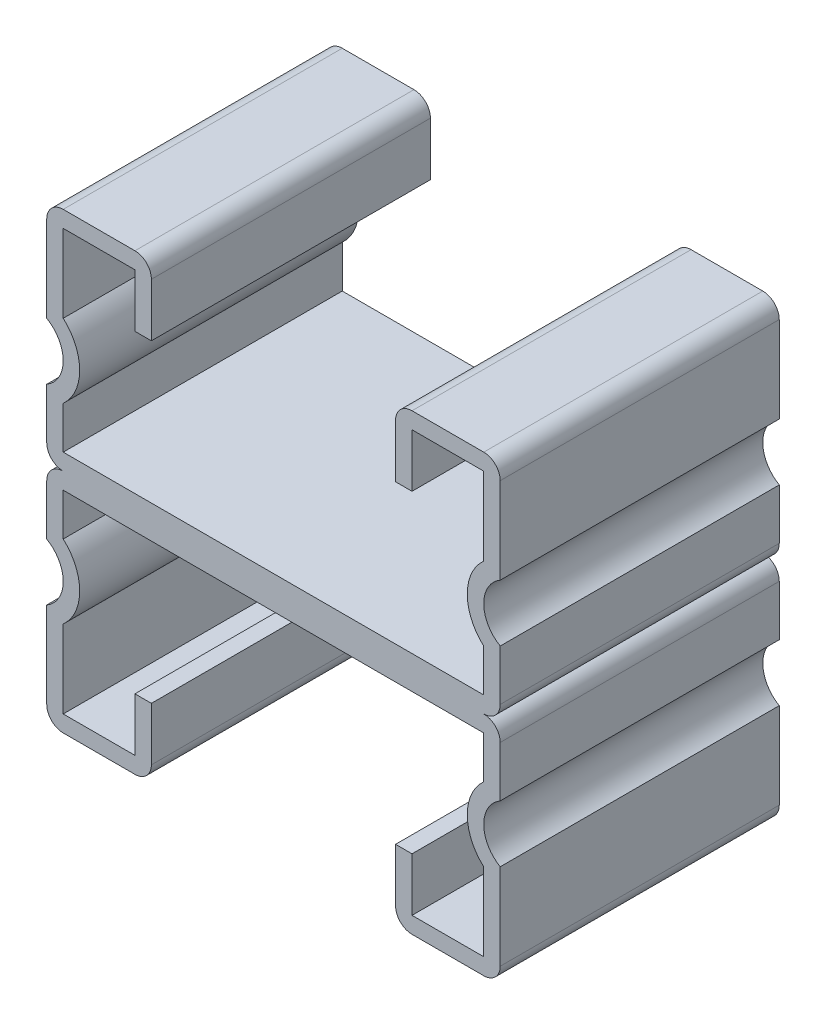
from build123d import *

# Parameters (mm, degrees)
BASE_EXTRUDE_DEPTH = 12.7


with BuildPart() as part:
    # Sketch1 → Base-Extrude (new, symmetric)
    with BuildSketch(Plane.XY):
        with BuildLine():
            Line((-20.6375, 19.1389), (-20.6375, 11.29515134))
            ThreePointArc((-20.6375, 11.29515134), (-19.1389, 8.6995), (-20.6375, 6.10384866))
            Line((-20.6375, 6.10384866), (-20.6375, 1.4986))
            ThreePointArc((-20.6375, 1.4986), (-20.198570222, 0.438929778), (-19.1389, 0))
            Line((-19.1389, 0), (19.1389, 0))
            ThreePointArc((19.1389, 0), (20.198570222, 0.438929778), (20.6375, 1.4986))
            Line((20.6375, 1.4986), (20.6375, 6.10384866))
            ThreePointArc((20.6375, 6.10384866), (19.1389, 8.6995), (20.6375, 11.29515134))
            Line((20.6375, 11.29515134), (20.6375, 19.1389))
            ThreePointArc((20.6375, 19.1389), (20.198570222, 20.198570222), (19.1389, 20.6375))
            Line((19.1389, 20.6375), (12.6111, 20.6375))
            ThreePointArc((12.6111, 20.6375), (11.551429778, 20.198570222), (11.1125, 19.1389))
            Line((11.1125, 19.1389), (11.1125, 14.2875))
            Line((11.1125, 14.2875), (12.6111, 14.2875))
            Line((12.6111, 14.2875), (12.6111, 19.1389))
            Line((12.6111, 19.1389), (19.1389, 19.1389))
            Line((19.1389, 19.1389), (19.1389, 12.050471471))
            ThreePointArc((19.1389, 12.050471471), (17.6403, 8.6995), (19.1389, 5.348528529))
            Line((19.1389, 5.348528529), (19.1389, 1.4986))
            Line((19.1389, 1.4986), (-19.1389, 1.4986))
            Line((-19.1389, 1.4986), (-19.1389, 5.348528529))
            ThreePointArc((-19.1389, 5.348528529), (-17.6403, 8.6995), (-19.1389, 12.050471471))
            Line((-19.1389, 12.050471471), (-19.1389, 19.1389))
            Line((-19.1389, 19.1389), (-12.6111, 19.1389))
            Line((-12.6111, 19.1389), (-12.6111, 14.2875))
            Line((-12.6111, 14.2875), (-11.1125, 14.2875))
            Line((-11.1125, 14.2875), (-11.1125, 19.1389))
            ThreePointArc((-11.1125, 19.1389), (-11.551429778, 20.198570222), (-12.6111, 20.6375))
            Line((-12.6111, 20.6375), (-19.1389, 20.6375))
            ThreePointArc((-19.1389, 20.6375), (-20.198570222, 20.198570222), (-20.6375, 19.1389))
        make_face()
    base_extrude = extrude(amount=BASE_EXTRUDE_DEPTH, both=True)

    # Mirror1: Base-Extrude across plane
    add(base_extrude.mirror(Plane.ZX))


solid = part.part
